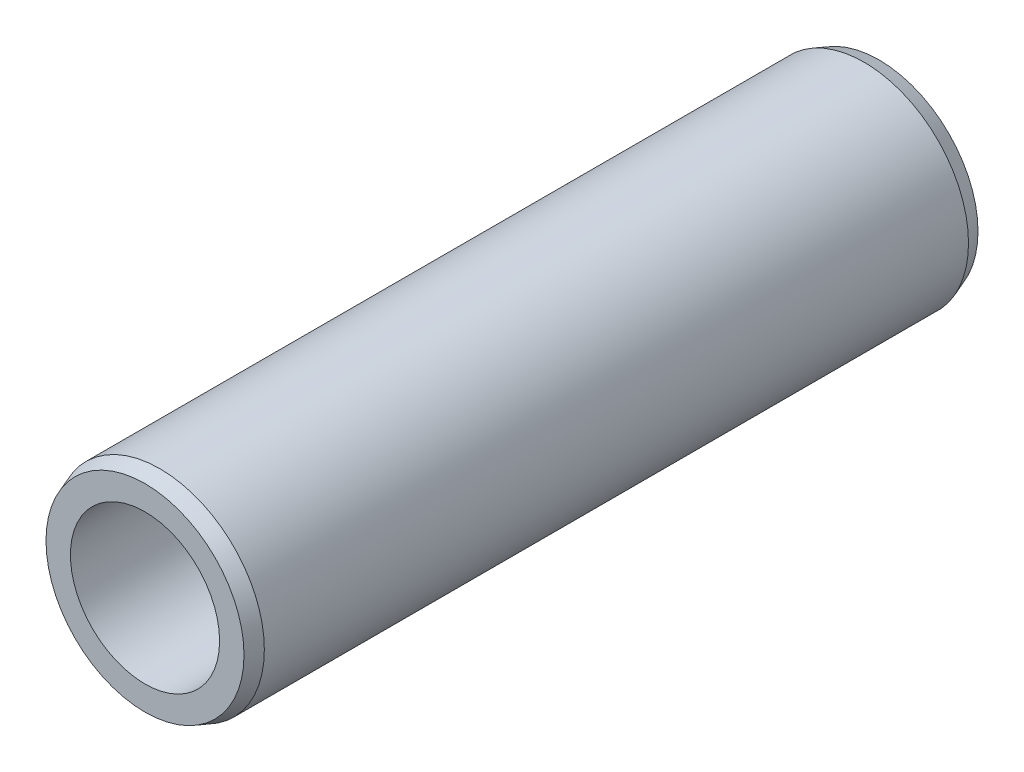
ISO-10303-21;
HEADER;
FILE_DESCRIPTION(('STEP AP214'),'2;1');
FILE_NAME('part.step','',(''),(''),'','','');
FILE_SCHEMA(('AUTOMOTIVE_DESIGN { 1 0 10303 214 1 1 1 1 }'));
ENDSEC;
DATA;
#1=APPLICATION_CONTEXT('core data for automotive mechanical design processes');
#2=APPLICATION_PROTOCOL_DEFINITION('international standard','automotive_design',2000,#1);
#3=PRODUCT_CONTEXT('',#1,'mechanical');
#4=PRODUCT('Part','Part','',(#3));
#5=PRODUCT_RELATED_PRODUCT_CATEGORY('part','',(#4));
#6=PRODUCT_DEFINITION_FORMATION('','',#4);
#7=PRODUCT_DEFINITION_CONTEXT('part definition',#1,'design');
#8=PRODUCT_DEFINITION('design','',#6,#7);
#9=PRODUCT_DEFINITION_SHAPE('','',#8);
#10=(LENGTH_UNIT() NAMED_UNIT(*) SI_UNIT(.MILLI.,.METRE.));
#11=(NAMED_UNIT(*) PLANE_ANGLE_UNIT() SI_UNIT($,.RADIAN.));
#12=(NAMED_UNIT(*) SI_UNIT($,.STERADIAN.) SOLID_ANGLE_UNIT());
#13=UNCERTAINTY_MEASURE_WITH_UNIT(LENGTH_MEASURE(1.E-05),#10,'distance_accuracy_value','');
#14=(GEOMETRIC_REPRESENTATION_CONTEXT(3) GLOBAL_UNCERTAINTY_ASSIGNED_CONTEXT((#13)) GLOBAL_UNIT_ASSIGNED_CONTEXT((#10,
#11,#12)) REPRESENTATION_CONTEXT('',''));
#15=CARTESIAN_POINT('',(0.,0.,0.));
#16=DIRECTION('',(0.,0.,1.));
#17=DIRECTION('',(1.,0.,0.));
#18=AXIS2_PLACEMENT_3D('',#15,#16,#17);
#19=CARTESIAN_POINT('',(0.,0.,0.));
#20=DIRECTION('',(0.,0.,1.));
#21=DIRECTION('',(1.,0.,0.));
#22=AXIS2_PLACEMENT_3D('',#19,#20,#21);
#23=CYLINDRICAL_SURFACE('',#22,2.5);
#24=CARTESIAN_POINT('',(0.,0.,12.3000000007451));
#25=DIRECTION('',(0.,0.,1.));
#26=DIRECTION('',(1.,0.,0.));
#27=AXIS2_PLACEMENT_3D('',#24,#25,#26);
#28=CIRCLE('',#27,2.5);
#29=CARTESIAN_POINT('',(2.5,0.,12.3000000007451));
#30=VERTEX_POINT('',#29);
#31=EDGE_CURVE('E36',#30,#30,#28,.F.);
#32=ORIENTED_EDGE('',*,*,#31,.F.);
#33=EDGE_LOOP('',(#32));
#34=FACE_BOUND('',#33,.T.);
#35=CARTESIAN_POINT('',(0.,0.,-12.3));
#36=DIRECTION('',(0.,0.,1.));
#37=DIRECTION('',(1.,0.,0.));
#38=AXIS2_PLACEMENT_3D('',#35,#36,#37);
#39=CIRCLE('',#38,2.5);
#40=CARTESIAN_POINT('',(2.5,0.,-12.3));
#41=VERTEX_POINT('',#40);
#42=EDGE_CURVE('E18',#41,#41,#39,.F.);
#43=ORIENTED_EDGE('',*,*,#42,.T.);
#44=EDGE_LOOP('',(#43));
#45=FACE_BOUND('',#44,.T.);
#46=ADVANCED_FACE('F15',(#34,#45),#23,.F.);
#47=CARTESIAN_POINT('',(0.,0.,-12.3));
#48=DIRECTION('',(0.,0.,1.));
#49=DIRECTION('',(1.,0.,0.));
#50=AXIS2_PLACEMENT_3D('',#47,#48,#49);
#51=PLANE('',#50);
#52=ORIENTED_EDGE('',*,*,#42,.F.);
#53=EDGE_LOOP('',(#52));
#54=FACE_BOUND('',#53,.T.);
#55=CARTESIAN_POINT('',(0.,1.395728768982E-13,-12.2999999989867));
#56=DIRECTION('',(0.,-2.80033932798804E-13,1.));
#57=DIRECTION('',(0.,-1.,-2.80033932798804E-13));
#58=AXIS2_PLACEMENT_3D('',#55,#56,#57);
#59=CIRCLE('',#58,3.31801487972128);
#60=CARTESIAN_POINT('',(0.,-3.31801487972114,-12.2999999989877));
#61=VERTEX_POINT('',#60);
#62=EDGE_CURVE('E34',#61,#61,#59,.T.);
#63=ORIENTED_EDGE('',*,*,#62,.F.);
#64=EDGE_LOOP('',(#63));
#65=FACE_BOUND('',#64,.T.);
#66=ADVANCED_FACE('F44',(#54,#65),#51,.F.);
#67=CARTESIAN_POINT('',(0.,0.,12.3));
#68=DIRECTION('',(0.,0.,1.));
#69=DIRECTION('',(1.,0.,0.));
#70=AXIS2_PLACEMENT_3D('',#67,#68,#69);
#71=PLANE('',#70);
#72=ORIENTED_EDGE('',*,*,#31,.T.);
#73=EDGE_LOOP('',(#72));
#74=FACE_BOUND('',#73,.T.);
#75=CARTESIAN_POINT('',(0.,-1.38418054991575E-13,12.2999999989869));
#76=DIRECTION('',(0.,2.77757681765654E-13,-1.));
#77=DIRECTION('',(0.,1.,2.77757681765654E-13));
#78=AXIS2_PLACEMENT_3D('',#75,#76,#77);
#79=CIRCLE('',#78,3.31801487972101);
#80=CARTESIAN_POINT('',(0.,3.31801487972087,12.2999999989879));
#81=VERTEX_POINT('',#80);
#82=EDGE_CURVE('E27',#81,#81,#79,.T.);
#83=ORIENTED_EDGE('',*,*,#82,.F.);
#84=EDGE_LOOP('',(#83));
#85=FACE_BOUND('',#84,.T.);
#86=ADVANCED_FACE('F47',(#74,#85),#71,.T.);
#87=CARTESIAN_POINT('',(0.,0.,-11.7999999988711));
#88=DIRECTION('',(0.,-2.80033932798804E-13,1.));
#89=DIRECTION('',(0.,-1.,-2.80033932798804E-13));
#90=AXIS2_PLACEMENT_3D('',#87,#88,#89);
#91=CONICAL_SURFACE('',#90,3.4999999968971,0.349065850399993);
#92=ORIENTED_EDGE('',*,*,#62,.T.);
#93=EDGE_LOOP('',(#92));
#94=FACE_BOUND('',#93,.T.);
#95=CARTESIAN_POINT('',(0.,0.,-11.8000000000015));
#96=DIRECTION('',(0.,0.,1.));
#97=DIRECTION('',(1.,0.,0.));
#98=AXIS2_PLACEMENT_3D('',#95,#96,#97);
#99=CIRCLE('',#98,3.5);
#100=CARTESIAN_POINT('',(3.5,0.,-11.8000000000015));
#101=VERTEX_POINT('',#100);
#102=EDGE_CURVE('E22',#101,#101,#99,.T.);
#103=ORIENTED_EDGE('',*,*,#102,.F.);
#104=EDGE_LOOP('',(#103));
#105=FACE_BOUND('',#104,.T.);
#106=ADVANCED_FACE('F50',(#94,#105),#91,.T.);
#107=CARTESIAN_POINT('',(0.,0.,11.7999999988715));
#108=DIRECTION('',(0.,2.77757681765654E-13,-1.));
#109=DIRECTION('',(0.,1.,2.77757681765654E-13));
#110=AXIS2_PLACEMENT_3D('',#107,#108,#109);
#111=CONICAL_SURFACE('',#110,3.49999999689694,0.349065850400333);
#112=CARTESIAN_POINT('',(0.,0.,11.8000000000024));
#113=DIRECTION('',(0.,0.,1.));
#114=DIRECTION('',(1.,0.,0.));
#115=AXIS2_PLACEMENT_3D('',#112,#113,#114);
#116=CIRCLE('',#115,3.5);
#117=CARTESIAN_POINT('',(3.5,0.,11.8000000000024));
#118=VERTEX_POINT('',#117);
#119=EDGE_CURVE('E10',#118,#118,#116,.F.);
#120=ORIENTED_EDGE('',*,*,#119,.F.);
#121=EDGE_LOOP('',(#120));
#122=FACE_BOUND('',#121,.T.);
#123=ORIENTED_EDGE('',*,*,#82,.T.);
#124=EDGE_LOOP('',(#123));
#125=FACE_BOUND('',#124,.T.);
#126=ADVANCED_FACE('F53',(#122,#125),#111,.T.);
#127=CARTESIAN_POINT('',(0.,0.,0.));
#128=DIRECTION('',(0.,0.,1.));
#129=DIRECTION('',(1.,0.,0.));
#130=AXIS2_PLACEMENT_3D('',#127,#128,#129);
#131=CYLINDRICAL_SURFACE('',#130,3.5);
#132=ORIENTED_EDGE('',*,*,#119,.T.);
#133=EDGE_LOOP('',(#132));
#134=FACE_BOUND('',#133,.T.);
#135=ORIENTED_EDGE('',*,*,#102,.T.);
#136=EDGE_LOOP('',(#135));
#137=FACE_BOUND('',#136,.T.);
#138=ADVANCED_FACE('F57',(#134,#137),#131,.T.);
#139=CLOSED_SHELL('',(#46,#66,#86,#106,#126,#138));
#140=MANIFOLD_SOLID_BREP('B1',#139);
#141=ADVANCED_BREP_SHAPE_REPRESENTATION('',(#18,#140),#14);
#142=SHAPE_DEFINITION_REPRESENTATION(#9,#141);
ENDSEC;
END-ISO-10303-21;
